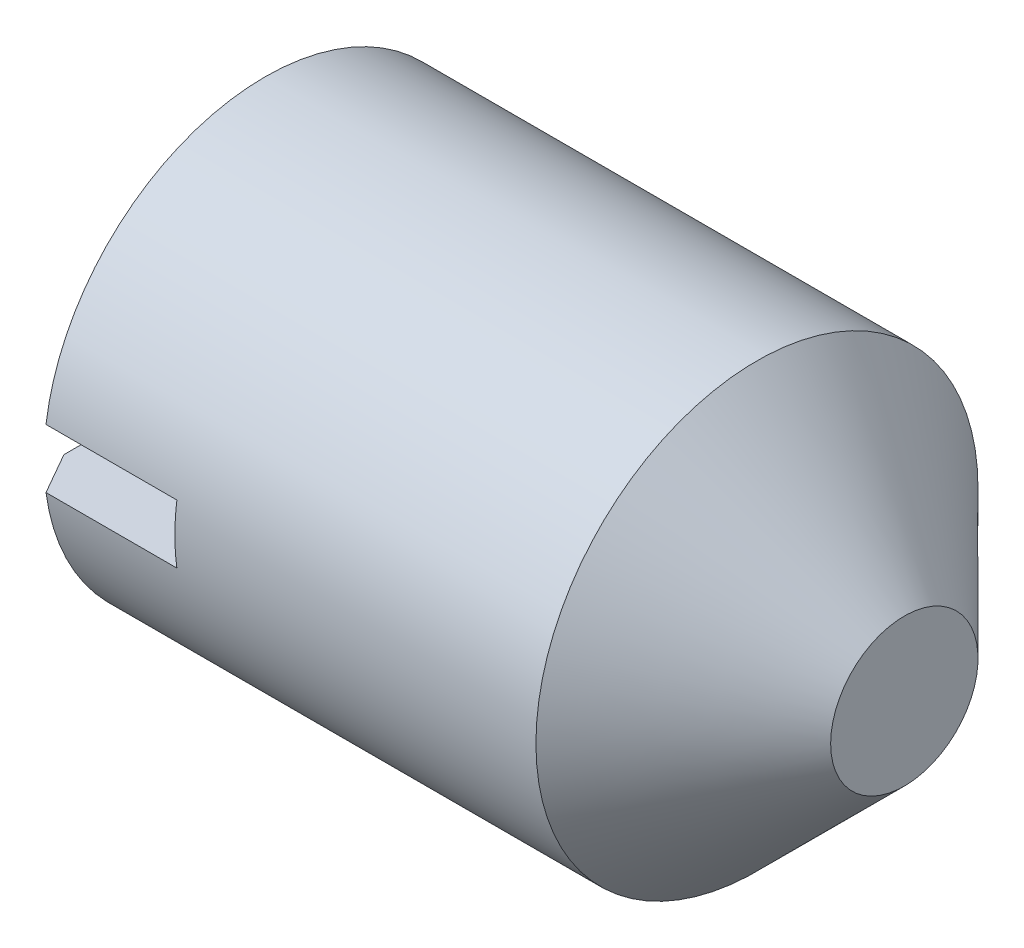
ISO-10303-21;
HEADER;
FILE_DESCRIPTION(('STEP AP214'),'2;1');
FILE_NAME('part.step','',(''),(''),'','','');
FILE_SCHEMA(('AUTOMOTIVE_DESIGN { 1 0 10303 214 1 1 1 1 }'));
ENDSEC;
DATA;
#1=APPLICATION_CONTEXT('core data for automotive mechanical design processes');
#2=APPLICATION_PROTOCOL_DEFINITION('international standard','automotive_design',2000,#1);
#3=PRODUCT_CONTEXT('',#1,'mechanical');
#4=PRODUCT('Part','Part','',(#3));
#5=PRODUCT_RELATED_PRODUCT_CATEGORY('part','',(#4));
#6=PRODUCT_DEFINITION_FORMATION('','',#4);
#7=PRODUCT_DEFINITION_CONTEXT('part definition',#1,'design');
#8=PRODUCT_DEFINITION('design','',#6,#7);
#9=PRODUCT_DEFINITION_SHAPE('','',#8);
#10=(LENGTH_UNIT() NAMED_UNIT(*) SI_UNIT(.MILLI.,.METRE.));
#11=(NAMED_UNIT(*) PLANE_ANGLE_UNIT() SI_UNIT($,.RADIAN.));
#12=(NAMED_UNIT(*) SI_UNIT($,.STERADIAN.) SOLID_ANGLE_UNIT());
#13=UNCERTAINTY_MEASURE_WITH_UNIT(LENGTH_MEASURE(1.E-05),#10,'distance_accuracy_value','');
#14=(GEOMETRIC_REPRESENTATION_CONTEXT(3) GLOBAL_UNCERTAINTY_ASSIGNED_CONTEXT((#13)) GLOBAL_UNIT_ASSIGNED_CONTEXT((#10,
#11,#12)) REPRESENTATION_CONTEXT('',''));
#15=CARTESIAN_POINT('',(0.,0.,0.));
#16=DIRECTION('',(0.,0.,1.));
#17=DIRECTION('',(1.,0.,0.));
#18=AXIS2_PLACEMENT_3D('',#15,#16,#17);
#19=CARTESIAN_POINT('',(0.,0.,0.));
#20=DIRECTION('',(-1.,0.,0.));
#21=DIRECTION('',(0.,0.,1.));
#22=AXIS2_PLACEMENT_3D('',#19,#20,#21);
#23=PLANE('',#22);
#24=CARTESIAN_POINT('',(0.,0.,0.));
#25=DIRECTION('',(-1.,0.,0.));
#26=DIRECTION('',(0.,0.,1.));
#27=AXIS2_PLACEMENT_3D('',#24,#25,#26);
#28=CIRCLE('',#27,1.2195);
#29=CARTESIAN_POINT('',(0.,-0.2,-1.20298805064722));
#30=VERTEX_POINT('',#29);
#31=CARTESIAN_POINT('',(0.,-0.2,1.20298805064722));
#32=VERTEX_POINT('',#31);
#33=EDGE_CURVE('E155',#30,#32,#28,.T.);
#34=ORIENTED_EDGE('',*,*,#33,.T.);
#35=DIRECTION('',(0.,0.,-1.));
#36=VECTOR('',#35,1.);
#37=CARTESIAN_POINT('',(0.,-0.2,1.5));
#38=LINE('',#37,#36);
#39=EDGE_CURVE('E112',#32,#30,#38,.T.);
#40=ORIENTED_EDGE('',*,*,#39,.T.);
#41=EDGE_LOOP('',(#34,#40));
#42=FACE_BOUND('',#41,.T.);
#43=ADVANCED_FACE('F36',(#42),#23,.T.);
#44=CARTESIAN_POINT('',(0.,0.,0.));
#45=DIRECTION('',(1.,0.,0.));
#46=DIRECTION('',(0.,0.,-1.));
#47=AXIS2_PLACEMENT_3D('',#44,#45,#46);
#48=CONICAL_SURFACE('',#47,1.2195,1.0471975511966);
#49=CARTESIAN_POINT('',(0.161946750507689,0.,0.));
#50=DIRECTION('',(-1.,0.,0.));
#51=DIRECTION('',(0.,0.,1.));
#52=AXIS2_PLACEMENT_3D('',#49,#50,#51);
#53=CIRCLE('',#52,1.5);
#54=CARTESIAN_POINT('',(0.161946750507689,-0.2,-1.48660687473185));
#55=VERTEX_POINT('',#54);
#56=CARTESIAN_POINT('',(0.161946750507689,-0.2,1.48660687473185));
#57=VERTEX_POINT('',#56);
#58=EDGE_CURVE('E160',#55,#57,#53,.T.);
#59=ORIENTED_EDGE('',*,*,#58,.T.);
#60=CARTESIAN_POINT('',(1.20629871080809,-0.2,3.30282076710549));
#61=CARTESIAN_POINT('',(1.1258848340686,-0.2,3.16328868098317));
#62=CARTESIAN_POINT('',(1.04548683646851,-0.2,3.02374748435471));
#63=CARTESIAN_POINT('',(0.884734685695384,-0.2,2.74464220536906));
#64=CARTESIAN_POINT('',(0.804380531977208,-0.2,2.60507812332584));
#65=CARTESIAN_POINT('',(0.563532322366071,-0.2,2.18657107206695));
#66=CARTESIAN_POINT('',(0.403118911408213,-0.2,1.90758155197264));
#67=CARTESIAN_POINT('',(0.203453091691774,-0.2,1.5591352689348));
#68=CARTESIAN_POINT('',(0.163813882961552,-0.2,1.48990028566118));
#69=CARTESIAN_POINT('',(0.0846214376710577,-0.2,1.35138417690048));
#70=CARTESIAN_POINT('',(0.045068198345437,-0.2,1.28210305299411));
#71=CARTESIAN_POINT('',(-0.0339277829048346,-0.2,1.14343154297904));
#72=CARTESIAN_POINT('',(-0.0733704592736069,-0.2,1.07404111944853));
#73=CARTESIAN_POINT('',(-0.15203026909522,-0.2,0.935122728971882));
#74=CARTESIAN_POINT('',(-0.191247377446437,-0.2,0.865594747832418));
#75=CARTESIAN_POINT('',(-0.269243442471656,-0.2,0.726327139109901));
#76=CARTESIAN_POINT('',(-0.308022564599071,-0.2,0.656587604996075));
#77=CARTESIAN_POINT('',(-0.365406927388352,-0.2,0.551558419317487));
#78=CARTESIAN_POINT('',(-0.384402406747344,-0.2,0.516482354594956));
#79=CARTESIAN_POINT('',(-0.421939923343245,-0.2,0.446089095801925));
#80=CARTESIAN_POINT('',(-0.440481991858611,-0.2,0.410771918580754));
#81=CARTESIAN_POINT('',(-0.467570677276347,-0.2,0.357595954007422));
#82=CARTESIAN_POINT('',(-0.476446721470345,-0.2,0.339905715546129));
#83=CARTESIAN_POINT('',(-0.493880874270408,-0.2,0.304364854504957));
#84=CARTESIAN_POINT('',(-0.502438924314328,-0.2,0.286514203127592));
#85=CARTESIAN_POINT('',(-0.519111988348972,-0.2,0.250508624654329));
#86=CARTESIAN_POINT('',(-0.527224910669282,-0.2,0.232352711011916));
#87=CARTESIAN_POINT('',(-0.54267790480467,-0.2,0.19572240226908));
#88=CARTESIAN_POINT('',(-0.550018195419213,-0.2,0.177248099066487));
#89=CARTESIAN_POINT('',(-0.565098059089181,-0.2,0.135214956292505));
#90=CARTESIAN_POINT('',(-0.572493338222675,-0.2,0.111521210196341));
#91=CARTESIAN_POINT('',(-0.580822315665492,-0.2,0.07545910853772));
#92=CARTESIAN_POINT('',(-0.583132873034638,-0.2,0.0634171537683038));
#93=CARTESIAN_POINT('',(-0.586609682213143,-0.2,0.0391732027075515));
#94=CARTESIAN_POINT('',(-0.587776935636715,-0.2,0.0269713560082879));
#95=CARTESIAN_POINT('',(-0.588820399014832,-0.2,0.00235568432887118));
#96=CARTESIAN_POINT('',(-0.588680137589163,-0.2,-0.010058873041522));
#97=CARTESIAN_POINT('',(-0.587089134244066,-0.2,-0.0348030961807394));
#98=CARTESIAN_POINT('',(-0.585638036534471,-0.2,-0.0471327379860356));
#99=CARTESIAN_POINT('',(-0.58159657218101,-0.2,-0.0717422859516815));
#100=CARTESIAN_POINT('',(-0.578993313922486,-0.2,-0.0840199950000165));
#101=CARTESIAN_POINT('',(-0.572904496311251,-0.2,-0.108351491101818));
#102=CARTESIAN_POINT('',(-0.569418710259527,-0.2,-0.120405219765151));
#103=CARTESIAN_POINT('',(-0.558447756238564,-0.2,-0.154857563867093));
#104=CARTESIAN_POINT('',(-0.550148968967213,-0.2,-0.17699252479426));
#105=CARTESIAN_POINT('',(-0.532322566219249,-0.2,-0.220768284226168));
#106=CARTESIAN_POINT('',(-0.522793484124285,-0.2,-0.242408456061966));
#107=CARTESIAN_POINT('',(-0.503003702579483,-0.2,-0.285415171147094));
#108=CARTESIAN_POINT('',(-0.492741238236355,-0.2,-0.306780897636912));
#109=CARTESIAN_POINT('',(-0.471779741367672,-0.2,-0.349298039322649));
#110=CARTESIAN_POINT('',(-0.461080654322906,-0.2,-0.370449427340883));
#111=CARTESIAN_POINT('',(-0.428496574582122,-0.2,-0.433836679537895));
#112=CARTESIAN_POINT('',(-0.406195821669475,-0.2,-0.475858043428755));
#113=CARTESIAN_POINT('',(-0.361115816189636,-0.2,-0.559540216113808));
#114=CARTESIAN_POINT('',(-0.338337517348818,-0.2,-0.601201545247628));
#115=CARTESIAN_POINT('',(-0.270113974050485,-0.2,-0.724978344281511));
#116=CARTESIAN_POINT('',(-0.224257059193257,-0.2,-0.806866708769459));
#117=CARTESIAN_POINT('',(-0.13212296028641,-0.2,-0.970408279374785));
#118=CARTESIAN_POINT('',(-0.0858457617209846,-0.2,-1.05206147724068));
#119=CARTESIAN_POINT('',(0.00696526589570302,-0.2,-1.21530054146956));
#120=CARTESIAN_POINT('',(0.0534992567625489,-0.2,-1.29688631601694));
#121=CARTESIAN_POINT('',(0.146690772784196,-0.2,-1.45998572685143));
#122=CARTESIAN_POINT('',(0.193348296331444,-0.2,-1.54149936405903));
#123=CARTESIAN_POINT('',(0.333088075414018,-0.2,-1.7853708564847));
#124=CARTESIAN_POINT('',(0.426282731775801,-0.2,-1.94766431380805));
#125=CARTESIAN_POINT('',(0.612788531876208,-0.2,-2.27214409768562));
#126=CARTESIAN_POINT('',(0.706099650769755,-0.2,-2.43433043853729));
#127=CARTESIAN_POINT('',(0.833307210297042,-0.2,-2.6553127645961));
#128=CARTESIAN_POINT('',(0.867170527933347,-0.200000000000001,-2.71412781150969));
#129=CARTESIAN_POINT('',(0.934906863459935,-0.200000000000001,-2.8317553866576));
#130=CARTESIAN_POINT('',(0.968779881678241,-0.200000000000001,-2.89056791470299));
#131=CARTESIAN_POINT('',(1.03659117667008,-0.200000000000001,-3.00829025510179));
#132=CARTESIAN_POINT('',(1.07052946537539,-0.200000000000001,-3.06720006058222));
#133=CARTESIAN_POINT('',(1.13841060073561,-0.200000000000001,-3.18501396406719));
#134=CARTESIAN_POINT('',(1.17235344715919,-0.200000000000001,-3.24391806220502));
#135=CARTESIAN_POINT('',(1.20629871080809,-0.200000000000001,-3.30282076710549));
#136=B_SPLINE_CURVE_WITH_KNOTS('',3,(#60,#61,#62,#63,#64,#65,#66,#67,#68,#69,#70,#71,#72,#73,
#74,#75,#76,#77,#78,#79,#80,#81,#82,#83,#84,#85,#86,#87,#88,#89,#90,#91,#92,#93,#94,#95,#96,#97,
#98,#99,#100,#101,#102,#103,#104,#105,#106,#107,#108,#109,#110,#111,#112,#113,#114,#115,#116,
#117,#118,#119,#120,#121,#122,#123,#124,#125,#126,#127,#128,#129,#130,#131,#132,#133,#134,#135),
.UNSPECIFIED.,.F.,.F.,(4,2,2,2,2,2,2,2,2,2,2,2,2,2,2,2,2,2,2,2,2,2,2,2,2,2,2,2,2,2,2,2,2,2,2,2,
2,4),(0.,0.483135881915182,0.966265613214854,1.93172257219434,2.17106066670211,2.41039094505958,
2.64984155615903,2.88931831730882,3.12870136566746,3.24836817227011,3.36802670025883,
3.42740075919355,3.48678569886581,3.5464292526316,3.6060558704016,3.68031927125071,
3.7170606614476,3.75376983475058,3.79094206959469,3.82812439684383,3.86573371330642,
3.90335270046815,3.97418935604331,4.04511124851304,4.11620996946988,4.18731759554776,
4.33002406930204,4.47246852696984,4.7540250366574,5.03559130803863,5.31736183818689,
5.5991287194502,6.16057277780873,6.72191257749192,6.92551367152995,7.12912274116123,
7.33308242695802,7.5370341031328),.UNSPECIFIED.);
#137=EDGE_CURVE('E57',#57,#32,#136,.T.);
#138=ORIENTED_EDGE('',*,*,#137,.T.);
#139=ORIENTED_EDGE('',*,*,#33,.F.);
#140=EDGE_CURVE('E166',#30,#55,#136,.T.);
#141=ORIENTED_EDGE('',*,*,#140,.T.);
#142=EDGE_LOOP('',(#59,#138,#139,#141));
#143=FACE_BOUND('',#142,.T.);
#144=ADVANCED_FACE('F139',(#143),#48,.T.);
#145=CARTESIAN_POINT('',(-12.7,0.,0.));
#146=DIRECTION('',(-1.,0.,0.));
#147=DIRECTION('',(0.,0.,1.));
#148=AXIS2_PLACEMENT_3D('',#145,#146,#147);
#149=CYLINDRICAL_SURFACE('',#148,1.5);
#150=CARTESIAN_POINT('',(3.5,0.,0.));
#151=DIRECTION('',(-1.,0.,0.));
#152=DIRECTION('',(0.,0.,1.));
#153=AXIS2_PLACEMENT_3D('',#150,#151,#152);
#154=CIRCLE('',#153,1.5);
#155=CARTESIAN_POINT('',(3.5,0.,1.5));
#156=VERTEX_POINT('',#155);
#157=EDGE_CURVE('E165',#156,#156,#154,.T.);
#158=ORIENTED_EDGE('',*,*,#157,.T.);
#159=EDGE_LOOP('',(#158));
#160=FACE_BOUND('',#159,.T.);
#161=ORIENTED_EDGE('',*,*,#58,.F.);
#162=DIRECTION('',(-1.,0.,0.));
#163=VECTOR('',#162,1.);
#164=CARTESIAN_POINT('',(-12.7,-0.2,-1.48660687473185));
#165=LINE('',#164,#163);
#166=CARTESIAN_POINT('',(1.05,-0.2,-1.48660687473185));
#167=VERTEX_POINT('',#166);
#168=EDGE_CURVE('E11',#55,#167,#165,.F.);
#169=ORIENTED_EDGE('',*,*,#168,.T.);
#170=CARTESIAN_POINT('',(1.05,0.,0.));
#171=DIRECTION('',(-1.,0.,0.));
#172=DIRECTION('',(0.,0.,1.));
#173=AXIS2_PLACEMENT_3D('',#170,#171,#172);
#174=CIRCLE('',#173,1.5);
#175=CARTESIAN_POINT('',(1.05,0.2,-1.48660687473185));
#176=VERTEX_POINT('',#175);
#177=EDGE_CURVE('E101',#167,#176,#174,.F.);
#178=ORIENTED_EDGE('',*,*,#177,.T.);
#179=DIRECTION('',(-1.,0.,0.));
#180=VECTOR('',#179,1.);
#181=CARTESIAN_POINT('',(-12.7,0.2,-1.48660687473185));
#182=LINE('',#181,#180);
#183=CARTESIAN_POINT('',(0.161946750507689,0.2,-1.48660687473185));
#184=VERTEX_POINT('',#183);
#185=EDGE_CURVE('E45',#184,#176,#182,.F.);
#186=ORIENTED_EDGE('',*,*,#185,.F.);
#187=CARTESIAN_POINT('',(0.161946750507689,0.2,1.48660687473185));
#188=VERTEX_POINT('',#187);
#189=EDGE_CURVE('E156',#188,#184,#53,.T.);
#190=ORIENTED_EDGE('',*,*,#189,.F.);
#191=DIRECTION('',(-1.,0.,0.));
#192=VECTOR('',#191,1.);
#193=CARTESIAN_POINT('',(-12.7,0.2,1.48660687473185));
#194=LINE('',#193,#192);
#195=CARTESIAN_POINT('',(1.05,0.2,1.48660687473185));
#196=VERTEX_POINT('',#195);
#197=EDGE_CURVE('E94',#196,#188,#194,.T.);
#198=ORIENTED_EDGE('',*,*,#197,.F.);
#199=CARTESIAN_POINT('',(1.05,-0.2,1.48660687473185));
#200=VERTEX_POINT('',#199);
#201=EDGE_CURVE('E88',#196,#200,#174,.F.);
#202=ORIENTED_EDGE('',*,*,#201,.T.);
#203=DIRECTION('',(-1.,0.,0.));
#204=VECTOR('',#203,1.);
#205=CARTESIAN_POINT('',(-12.7,-0.2,1.48660687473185));
#206=LINE('',#205,#204);
#207=EDGE_CURVE('E91',#200,#57,#206,.T.);
#208=ORIENTED_EDGE('',*,*,#207,.T.);
#209=EDGE_LOOP('',(#161,#169,#178,#186,#190,#198,#202,#208));
#210=FACE_BOUND('',#209,.T.);
#211=ADVANCED_FACE('F90',(#160,#210),#149,.T.);
#212=DIRECTION('',(0.,0.,-1.));
#213=VECTOR('',#212,1.);
#214=CARTESIAN_POINT('',(0.,0.2,1.5));
#215=LINE('',#214,#213);
#216=CARTESIAN_POINT('',(0.,0.2,1.20298805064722));
#217=VERTEX_POINT('',#216);
#218=CARTESIAN_POINT('',(0.,0.2,-1.20298805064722));
#219=VERTEX_POINT('',#218);
#220=EDGE_CURVE('E170',#217,#219,#215,.T.);
#221=ORIENTED_EDGE('',*,*,#220,.F.);
#222=EDGE_CURVE('E99',#217,#219,#28,.T.);
#223=ORIENTED_EDGE('',*,*,#222,.T.);
#224=EDGE_LOOP('',(#221,#223));
#225=FACE_BOUND('',#224,.T.);
#226=ADVANCED_FACE('F38',(#225),#23,.T.);
#227=CARTESIAN_POINT('',(1.20629871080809,0.2,3.30282076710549));
#228=CARTESIAN_POINT('',(1.1258848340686,0.2,3.16328868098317));
#229=CARTESIAN_POINT('',(1.04548683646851,0.2,3.02374748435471));
#230=CARTESIAN_POINT('',(0.884734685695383,0.2,2.74464220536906));
#231=CARTESIAN_POINT('',(0.804380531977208,0.2,2.60507812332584));
#232=CARTESIAN_POINT('',(0.563532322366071,0.2,2.18657107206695));
#233=CARTESIAN_POINT('',(0.403118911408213,0.2,1.90758155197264));
#234=CARTESIAN_POINT('',(0.203453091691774,0.2,1.5591352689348));
#235=CARTESIAN_POINT('',(0.163813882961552,0.2,1.48990028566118));
#236=CARTESIAN_POINT('',(0.0846214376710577,0.2,1.35138417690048));
#237=CARTESIAN_POINT('',(0.0450681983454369,0.2,1.28210305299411));
#238=CARTESIAN_POINT('',(-0.0339277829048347,0.2,1.14343154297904));
#239=CARTESIAN_POINT('',(-0.073370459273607,0.2,1.07404111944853));
#240=CARTESIAN_POINT('',(-0.152030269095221,0.2,0.935122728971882));
#241=CARTESIAN_POINT('',(-0.191247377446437,0.2,0.865594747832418));
#242=CARTESIAN_POINT('',(-0.269243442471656,0.2,0.726327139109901));
#243=CARTESIAN_POINT('',(-0.308022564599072,0.2,0.656587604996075));
#244=CARTESIAN_POINT('',(-0.365406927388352,0.2,0.551558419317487));
#245=CARTESIAN_POINT('',(-0.384402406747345,0.2,0.516482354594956));
#246=CARTESIAN_POINT('',(-0.421939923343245,0.2,0.446089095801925));
#247=CARTESIAN_POINT('',(-0.440481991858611,0.2,0.410771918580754));
#248=CARTESIAN_POINT('',(-0.467570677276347,0.2,0.357595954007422));
#249=CARTESIAN_POINT('',(-0.476446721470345,0.2,0.339905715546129));
#250=CARTESIAN_POINT('',(-0.493880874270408,0.2,0.304364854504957));
#251=CARTESIAN_POINT('',(-0.502438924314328,0.2,0.286514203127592));
#252=CARTESIAN_POINT('',(-0.519111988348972,0.2,0.250508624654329));
#253=CARTESIAN_POINT('',(-0.527224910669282,0.2,0.232352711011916));
#254=CARTESIAN_POINT('',(-0.54267790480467,0.2,0.19572240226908));
#255=CARTESIAN_POINT('',(-0.550018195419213,0.2,0.177248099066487));
#256=CARTESIAN_POINT('',(-0.565098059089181,0.2,0.135214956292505));
#257=CARTESIAN_POINT('',(-0.572493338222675,0.2,0.111521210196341));
#258=CARTESIAN_POINT('',(-0.580822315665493,0.2,0.0754591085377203));
#259=CARTESIAN_POINT('',(-0.583132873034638,0.2,0.0634171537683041));
#260=CARTESIAN_POINT('',(-0.586609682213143,0.2,0.0391732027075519));
#261=CARTESIAN_POINT('',(-0.587776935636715,0.2,0.0269713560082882));
#262=CARTESIAN_POINT('',(-0.588820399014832,0.2,0.00235568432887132));
#263=CARTESIAN_POINT('',(-0.588680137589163,0.2,-0.010058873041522));
#264=CARTESIAN_POINT('',(-0.587089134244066,0.2,-0.0348030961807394));
#265=CARTESIAN_POINT('',(-0.585638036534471,0.2,-0.0471327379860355));
#266=CARTESIAN_POINT('',(-0.581596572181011,0.2,-0.0717422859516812));
#267=CARTESIAN_POINT('',(-0.578993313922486,0.2,-0.0840199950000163));
#268=CARTESIAN_POINT('',(-0.572904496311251,0.2,-0.108351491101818));
#269=CARTESIAN_POINT('',(-0.569418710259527,0.2,-0.120405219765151));
#270=CARTESIAN_POINT('',(-0.558447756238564,0.2,-0.154857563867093));
#271=CARTESIAN_POINT('',(-0.550148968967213,0.2,-0.17699252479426));
#272=CARTESIAN_POINT('',(-0.532322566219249,0.2,-0.220768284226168));
#273=CARTESIAN_POINT('',(-0.522793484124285,0.2,-0.242408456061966));
#274=CARTESIAN_POINT('',(-0.503003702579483,0.2,-0.285415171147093));
#275=CARTESIAN_POINT('',(-0.492741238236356,0.2,-0.306780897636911));
#276=CARTESIAN_POINT('',(-0.471779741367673,0.2,-0.349298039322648));
#277=CARTESIAN_POINT('',(-0.461080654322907,0.2,-0.370449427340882));
#278=CARTESIAN_POINT('',(-0.428496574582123,0.2,-0.433836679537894));
#279=CARTESIAN_POINT('',(-0.406195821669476,0.2,-0.475858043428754));
#280=CARTESIAN_POINT('',(-0.361115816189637,0.2,-0.559540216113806));
#281=CARTESIAN_POINT('',(-0.338337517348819,0.2,-0.601201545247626));
#282=CARTESIAN_POINT('',(-0.270113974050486,0.2,-0.724978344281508));
#283=CARTESIAN_POINT('',(-0.224257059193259,0.2,-0.806866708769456));
#284=CARTESIAN_POINT('',(-0.132122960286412,0.2,-0.970408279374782));
#285=CARTESIAN_POINT('',(-0.085845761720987,0.2,-1.05206147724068));
#286=CARTESIAN_POINT('',(0.00696526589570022,0.2,-1.21530054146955));
#287=CARTESIAN_POINT('',(0.0534992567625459,0.2,-1.29688631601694));
#288=CARTESIAN_POINT('',(0.146690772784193,0.2,-1.45998572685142));
#289=CARTESIAN_POINT('',(0.19334829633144,0.2,-1.54149936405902));
#290=CARTESIAN_POINT('',(0.333088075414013,0.2,-1.78537085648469));
#291=CARTESIAN_POINT('',(0.426282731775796,0.2,-1.94766431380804));
#292=CARTESIAN_POINT('',(0.612788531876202,0.2,-2.27214409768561));
#293=CARTESIAN_POINT('',(0.706099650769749,0.2,-2.43433043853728));
#294=CARTESIAN_POINT('',(0.833307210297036,0.2,-2.65531276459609));
#295=CARTESIAN_POINT('',(0.867170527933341,0.2,-2.71412781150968));
#296=CARTESIAN_POINT('',(0.934906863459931,0.2,-2.83175538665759));
#297=CARTESIAN_POINT('',(0.968779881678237,0.2,-2.89056791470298));
#298=CARTESIAN_POINT('',(1.03659117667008,0.2,-3.00829025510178));
#299=CARTESIAN_POINT('',(1.07052946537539,0.2,-3.06720006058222));
#300=CARTESIAN_POINT('',(1.13841060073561,0.2,-3.18501396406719));
#301=CARTESIAN_POINT('',(1.17235344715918,0.2,-3.24391806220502));
#302=CARTESIAN_POINT('',(1.20629871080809,0.2,-3.30282076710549));
#303=B_SPLINE_CURVE_WITH_KNOTS('',3,(#227,#228,#229,#230,#231,#232,#233,#234,#235,#236,#237,
#238,#239,#240,#241,#242,#243,#244,#245,#246,#247,#248,#249,#250,#251,#252,#253,#254,#255,#256,
#257,#258,#259,#260,#261,#262,#263,#264,#265,#266,#267,#268,#269,#270,#271,#272,#273,#274,#275,
#276,#277,#278,#279,#280,#281,#282,#283,#284,#285,#286,#287,#288,#289,#290,#291,#292,#293,#294,
#295,#296,#297,#298,#299,#300,#301,#302),.UNSPECIFIED.,.F.,.F.,(4,2,2,2,2,2,2,2,2,2,2,2,2,2,2,2,
2,2,2,2,2,2,2,2,2,2,2,2,2,2,2,2,2,2,2,2,2,4),(0.,0.483135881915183,0.966265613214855,
1.93172257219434,2.17106066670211,2.41039094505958,2.64984155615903,2.88931831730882,
3.12870136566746,3.24836817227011,3.36802670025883,3.42740075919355,3.48678569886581,
3.5464292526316,3.6060558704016,3.68031927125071,3.71706066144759,3.75376983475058,
3.79094206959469,3.82812439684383,3.86573371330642,3.90335270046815,3.97418935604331,
4.04511124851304,4.11620996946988,4.18731759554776,4.33002406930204,4.47246852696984,
4.75402503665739,5.03559130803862,5.31736183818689,5.59912871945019,6.16057277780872,
6.72191257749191,6.92551367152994,7.12912274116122,7.33308242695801,7.5370341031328),.UNSPECIFIED.);
#304=EDGE_CURVE('E107',#188,#217,#303,.T.);
#305=ORIENTED_EDGE('',*,*,#304,.F.);
#306=ORIENTED_EDGE('',*,*,#189,.T.);
#307=EDGE_CURVE('E110',#219,#184,#303,.T.);
#308=ORIENTED_EDGE('',*,*,#307,.F.);
#309=ORIENTED_EDGE('',*,*,#222,.F.);
#310=EDGE_LOOP('',(#305,#306,#308,#309));
#311=FACE_BOUND('',#310,.T.);
#312=ADVANCED_FACE('F125',(#311),#48,.T.);
#313=CARTESIAN_POINT('',(3.5,0.,0.));
#314=DIRECTION('',(-1.,0.,0.));
#315=DIRECTION('',(0.,0.,1.));
#316=AXIS2_PLACEMENT_3D('',#313,#314,#315);
#317=CONICAL_SURFACE('',#316,1.5,0.78539816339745);
#318=CARTESIAN_POINT('',(4.5,0.,0.));
#319=DIRECTION('',(-1.,0.,0.));
#320=DIRECTION('',(0.,0.,1.));
#321=AXIS2_PLACEMENT_3D('',#318,#319,#320);
#322=CIRCLE('',#321,0.500000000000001);
#323=CARTESIAN_POINT('',(4.5,0.,0.5));
#324=VERTEX_POINT('',#323);
#325=EDGE_CURVE('E40',#324,#324,#322,.F.);
#326=CARTESIAN_POINT('',(4.5,0.,0.5));
#327=CARTESIAN_POINT('',(4.48958333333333,0.,0.510416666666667));
#328=CARTESIAN_POINT('',(4.47916666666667,0.,0.520833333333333));
#329=CARTESIAN_POINT('',(4.45833333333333,0.,0.541666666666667));
#330=CARTESIAN_POINT('',(4.44791666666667,0.,0.552083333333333));
#331=CARTESIAN_POINT('',(4.42708333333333,0.,0.572916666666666));
#332=CARTESIAN_POINT('',(4.41666666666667,0.,0.583333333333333));
#333=CARTESIAN_POINT('',(4.39583333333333,0.,0.604166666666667));
#334=CARTESIAN_POINT('',(4.38541666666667,0.,0.614583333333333));
#335=CARTESIAN_POINT('',(4.36458333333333,0.,0.635416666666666));
#336=CARTESIAN_POINT('',(4.35416666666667,0.,0.645833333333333));
#337=CARTESIAN_POINT('',(4.33333333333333,0.,0.666666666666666));
#338=CARTESIAN_POINT('',(4.32291666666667,0.,0.677083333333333));
#339=CARTESIAN_POINT('',(4.30208333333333,0.,0.697916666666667));
#340=CARTESIAN_POINT('',(4.29166666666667,0.,0.708333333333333));
#341=CARTESIAN_POINT('',(4.27083333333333,0.,0.729166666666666));
#342=CARTESIAN_POINT('',(4.26041666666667,0.,0.739583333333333));
#343=CARTESIAN_POINT('',(4.23958333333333,0.,0.760416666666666));
#344=CARTESIAN_POINT('',(4.22916666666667,0.,0.770833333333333));
#345=CARTESIAN_POINT('',(4.20833333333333,0.,0.791666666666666));
#346=CARTESIAN_POINT('',(4.19791666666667,0.,0.802083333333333));
#347=CARTESIAN_POINT('',(4.17708333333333,0.,0.822916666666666));
#348=CARTESIAN_POINT('',(4.16666666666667,0.,0.833333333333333));
#349=CARTESIAN_POINT('',(4.14583333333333,0.,0.854166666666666));
#350=CARTESIAN_POINT('',(4.13541666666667,0.,0.864583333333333));
#351=CARTESIAN_POINT('',(4.11458333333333,0.,0.885416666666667));
#352=CARTESIAN_POINT('',(4.10416666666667,0.,0.895833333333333));
#353=CARTESIAN_POINT('',(4.08333333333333,0.,0.916666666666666));
#354=CARTESIAN_POINT('',(4.07291666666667,0.,0.927083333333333));
#355=CARTESIAN_POINT('',(4.05208333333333,0.,0.947916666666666));
#356=CARTESIAN_POINT('',(4.04166666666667,0.,0.958333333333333));
#357=CARTESIAN_POINT('',(4.02083333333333,0.,0.979166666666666));
#358=CARTESIAN_POINT('',(4.01041666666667,0.,0.989583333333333));
#359=CARTESIAN_POINT('',(3.98958333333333,0.,1.01041666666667));
#360=CARTESIAN_POINT('',(3.97916666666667,0.,1.02083333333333));
#361=CARTESIAN_POINT('',(3.95833333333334,0.,1.04166666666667));
#362=CARTESIAN_POINT('',(3.94791666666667,0.,1.05208333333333));
#363=CARTESIAN_POINT('',(3.92708333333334,0.,1.07291666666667));
#364=CARTESIAN_POINT('',(3.91666666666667,0.,1.08333333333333));
#365=CARTESIAN_POINT('',(3.89583333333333,0.,1.10416666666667));
#366=CARTESIAN_POINT('',(3.88541666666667,0.,1.11458333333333));
#367=CARTESIAN_POINT('',(3.86458333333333,0.,1.13541666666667));
#368=CARTESIAN_POINT('',(3.85416666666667,0.,1.14583333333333));
#369=CARTESIAN_POINT('',(3.83333333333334,0.,1.16666666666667));
#370=CARTESIAN_POINT('',(3.82291666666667,0.,1.17708333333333));
#371=CARTESIAN_POINT('',(3.80208333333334,0.,1.19791666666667));
#372=CARTESIAN_POINT('',(3.79166666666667,0.,1.20833333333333));
#373=CARTESIAN_POINT('',(3.77083333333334,0.,1.22916666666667));
#374=CARTESIAN_POINT('',(3.76041666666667,0.,1.23958333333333));
#375=CARTESIAN_POINT('',(3.73958333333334,0.,1.26041666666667));
#376=CARTESIAN_POINT('',(3.72916666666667,0.,1.27083333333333));
#377=CARTESIAN_POINT('',(3.70833333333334,0.,1.29166666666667));
#378=CARTESIAN_POINT('',(3.69791666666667,0.,1.30208333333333));
#379=CARTESIAN_POINT('',(3.67708333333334,0.,1.32291666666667));
#380=CARTESIAN_POINT('',(3.66666666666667,0.,1.33333333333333));
#381=CARTESIAN_POINT('',(3.64583333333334,0.,1.35416666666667));
#382=CARTESIAN_POINT('',(3.63541666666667,0.,1.36458333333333));
#383=CARTESIAN_POINT('',(3.61458333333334,0.,1.38541666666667));
#384=CARTESIAN_POINT('',(3.60416666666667,0.,1.39583333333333));
#385=CARTESIAN_POINT('',(3.58333333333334,0.,1.41666666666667));
#386=CARTESIAN_POINT('',(3.57291666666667,0.,1.42708333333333));
#387=CARTESIAN_POINT('',(3.55208333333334,0.,1.44791666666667));
#388=CARTESIAN_POINT('',(3.54166666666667,0.,1.45833333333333));
#389=CARTESIAN_POINT('',(3.52083333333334,0.,1.47916666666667));
#390=CARTESIAN_POINT('',(3.51041666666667,0.,1.48958333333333));
#391=CARTESIAN_POINT('',(3.5,0.,1.5));
#392=B_SPLINE_CURVE_WITH_KNOTS('',3,(#326,#327,#328,#329,#330,#331,#332,#333,#334,#335,#336,
#337,#338,#339,#340,#341,#342,#343,#344,#345,#346,#347,#348,#349,#350,#351,#352,#353,#354,#355,
#356,#357,#358,#359,#360,#361,#362,#363,#364,#365,#366,#367,#368,#369,#370,#371,#372,#373,#374,
#375,#376,#377,#378,#379,#380,#381,#382,#383,#384,#385,#386,#387,#388,#389,#390,#391),
.UNSPECIFIED.,.F.,.F.,(4,2,2,2,2,2,2,2,2,2,2,2,2,2,2,2,2,2,2,2,2,2,2,2,2,2,2,2,2,2,2,2,4),(0.,
0.0441941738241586,0.0883883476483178,0.132582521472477,0.176776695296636,0.220970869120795,
0.265165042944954,0.309359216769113,0.353553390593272,0.397747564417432,0.441941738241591,
0.48613591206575,0.530330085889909,0.574524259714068,0.618718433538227,0.662912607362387,
0.707106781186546,0.751300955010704,0.795495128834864,0.839689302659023,0.883883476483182,
0.928077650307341,0.9722718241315,1.01646599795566,1.06066017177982,1.10485434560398,
1.14904851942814,1.1932426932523,1.23743686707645,1.28163104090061,1.32582521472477,
1.37001938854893,1.41421356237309),.UNSPECIFIED.);
#393=EDGE_CURVE('BSEAM135',#324,#156,#392,.T.);
#394=ORIENTED_EDGE('',*,*,#325,.F.);
#395=ORIENTED_EDGE('',*,*,#157,.F.);
#396=ORIENTED_EDGE('',*,*,#393,.T.);
#397=ORIENTED_EDGE('',*,*,#393,.F.);
#398=EDGE_LOOP('',(#394,#396,#395,#397));
#399=FACE_BOUND('',#398,.T.);
#400=ADVANCED_FACE('F135',(#399),#317,.T.);
#401=CARTESIAN_POINT('',(1.05,-0.2,1.5));
#402=DIRECTION('',(0.,1.,0.));
#403=DIRECTION('',(0.,0.,1.));
#404=AXIS2_PLACEMENT_3D('',#401,#402,#403);
#405=PLANE('',#404);
#406=ORIENTED_EDGE('',*,*,#39,.F.);
#407=ORIENTED_EDGE('',*,*,#137,.F.);
#408=ORIENTED_EDGE('',*,*,#207,.F.);
#409=DIRECTION('',(0.,0.,-1.));
#410=VECTOR('',#409,1.);
#411=CARTESIAN_POINT('',(1.05,-0.2,1.5));
#412=LINE('',#411,#410);
#413=EDGE_CURVE('E103',#200,#167,#412,.T.);
#414=ORIENTED_EDGE('',*,*,#413,.T.);
#415=ORIENTED_EDGE('',*,*,#168,.F.);
#416=ORIENTED_EDGE('',*,*,#140,.F.);
#417=EDGE_LOOP('',(#406,#407,#408,#414,#415,#416));
#418=FACE_BOUND('',#417,.T.);
#419=ADVANCED_FACE('F102',(#418),#405,.T.);
#420=CARTESIAN_POINT('',(1.05,0.2,1.5));
#421=DIRECTION('',(0.,1.,0.));
#422=DIRECTION('',(0.,0.,1.));
#423=AXIS2_PLACEMENT_3D('',#420,#421,#422);
#424=PLANE('',#423);
#425=ORIENTED_EDGE('',*,*,#307,.T.);
#426=ORIENTED_EDGE('',*,*,#185,.T.);
#427=DIRECTION('',(0.,0.,-1.));
#428=VECTOR('',#427,1.);
#429=CARTESIAN_POINT('',(1.05,0.2,1.5));
#430=LINE('',#429,#428);
#431=EDGE_CURVE('E108',#196,#176,#430,.T.);
#432=ORIENTED_EDGE('',*,*,#431,.F.);
#433=ORIENTED_EDGE('',*,*,#197,.T.);
#434=ORIENTED_EDGE('',*,*,#304,.T.);
#435=ORIENTED_EDGE('',*,*,#220,.T.);
#436=EDGE_LOOP('',(#425,#426,#432,#433,#434,#435));
#437=FACE_BOUND('',#436,.T.);
#438=ADVANCED_FACE('F128',(#437),#424,.F.);
#439=CARTESIAN_POINT('',(1.05,0.2,1.5));
#440=DIRECTION('',(-1.,0.,0.));
#441=DIRECTION('',(0.,0.,1.));
#442=AXIS2_PLACEMENT_3D('',#439,#440,#441);
#443=PLANE('',#442);
#444=ORIENTED_EDGE('',*,*,#413,.F.);
#445=ORIENTED_EDGE('',*,*,#201,.F.);
#446=ORIENTED_EDGE('',*,*,#431,.T.);
#447=ORIENTED_EDGE('',*,*,#177,.F.);
#448=EDGE_LOOP('',(#444,#445,#446,#447));
#449=FACE_BOUND('',#448,.T.);
#450=ADVANCED_FACE('F105',(#449),#443,.T.);
#451=CARTESIAN_POINT('',(4.5,-1.5,-0.889575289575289));
#452=DIRECTION('',(-1.,0.,0.));
#453=DIRECTION('',(0.,0.,1.));
#454=AXIS2_PLACEMENT_3D('',#451,#452,#453);
#455=PLANE('',#454);
#456=ORIENTED_EDGE('',*,*,#325,.T.);
#457=EDGE_LOOP('',(#456));
#458=FACE_BOUND('',#457,.T.);
#459=ADVANCED_FACE('F178',(#458),#455,.F.);
#460=CLOSED_SHELL('',(#43,#144,#211,#226,#312,#400,#419,#438,#450,#459));
#461=MANIFOLD_SOLID_BREP('B2',#460);
#462=ADVANCED_BREP_SHAPE_REPRESENTATION('',(#18,#461),#14);
#463=SHAPE_DEFINITION_REPRESENTATION(#9,#462);
ENDSEC;
END-ISO-10303-21;
